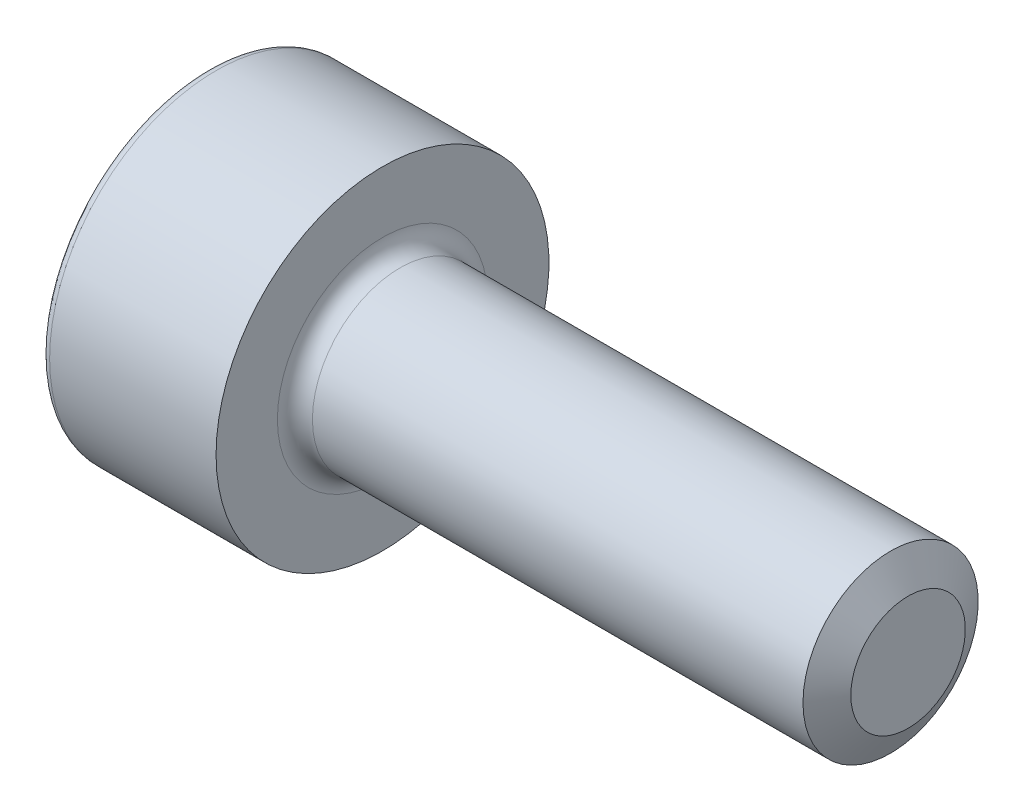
ISO-10303-21;
HEADER;
FILE_DESCRIPTION(('STEP AP214'),'2;1');
FILE_NAME('part.step','',(''),(''),'','','');
FILE_SCHEMA(('AUTOMOTIVE_DESIGN { 1 0 10303 214 1 1 1 1 }'));
ENDSEC;
DATA;
#1=APPLICATION_CONTEXT('core data for automotive mechanical design processes');
#2=APPLICATION_PROTOCOL_DEFINITION('international standard','automotive_design',2000,#1);
#3=PRODUCT_CONTEXT('',#1,'mechanical');
#4=PRODUCT('Part','Part','',(#3));
#5=PRODUCT_RELATED_PRODUCT_CATEGORY('part','',(#4));
#6=PRODUCT_DEFINITION_FORMATION('','',#4);
#7=PRODUCT_DEFINITION_CONTEXT('part definition',#1,'design');
#8=PRODUCT_DEFINITION('design','',#6,#7);
#9=PRODUCT_DEFINITION_SHAPE('','',#8);
#10=(LENGTH_UNIT() NAMED_UNIT(*) SI_UNIT(.MILLI.,.METRE.));
#11=(NAMED_UNIT(*) PLANE_ANGLE_UNIT() SI_UNIT($,.RADIAN.));
#12=(NAMED_UNIT(*) SI_UNIT($,.STERADIAN.) SOLID_ANGLE_UNIT());
#13=UNCERTAINTY_MEASURE_WITH_UNIT(LENGTH_MEASURE(1.E-05),#10,'distance_accuracy_value','');
#14=(GEOMETRIC_REPRESENTATION_CONTEXT(3) GLOBAL_UNCERTAINTY_ASSIGNED_CONTEXT((#13)) GLOBAL_UNIT_ASSIGNED_CONTEXT((#10,
#11,#12)) REPRESENTATION_CONTEXT('',''));
#15=CARTESIAN_POINT('',(0.,0.,0.));
#16=DIRECTION('',(0.,0.,1.));
#17=DIRECTION('',(1.,0.,0.));
#18=AXIS2_PLACEMENT_3D('',#15,#16,#17);
#19=CARTESIAN_POINT('',(8.,1.,0.));
#20=DIRECTION('',(-1.,0.,0.));
#21=DIRECTION('',(0.,0.,1.));
#22=AXIS2_PLACEMENT_3D('',#19,#20,#21);
#23=PLANE('',#22);
#24=CARTESIAN_POINT('',(8.,0.,0.));
#25=DIRECTION('',(-1.,0.,0.));
#26=DIRECTION('',(0.,0.,1.));
#27=AXIS2_PLACEMENT_3D('',#24,#25,#26);
#28=CIRCLE('',#27,0.6536);
#29=CARTESIAN_POINT('',(8.,0.,0.6536));
#30=VERTEX_POINT('',#29);
#31=EDGE_CURVE('E234',#30,#30,#28,.T.);
#32=ORIENTED_EDGE('',*,*,#31,.F.);
#33=EDGE_LOOP('',(#32));
#34=FACE_BOUND('',#33,.T.);
#35=ADVANCED_FACE('F17',(#34),#23,.F.);
#36=CARTESIAN_POINT('',(1.,0.749111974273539,0.4325));
#37=DIRECTION('',(-0.996035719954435,-0.0444770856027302,-0.0770365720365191));
#38=DIRECTION('',(-0.0771128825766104,0.,0.997022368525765));
#39=AXIS2_PLACEMENT_3D('',#36,#37,#38);
#40=PLANE('',#39);
#41=DIRECTION('',(-0.0771128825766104,0.863446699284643,0.498511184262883));
#42=VECTOR('',#41,1.);
#43=CARTESIAN_POINT('',(1.06690185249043,0.,0.));
#44=LINE('',#43,#42);
#45=CARTESIAN_POINT('',(1.06690185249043,0.,0.));
#46=VERTEX_POINT('',#45);
#47=CARTESIAN_POINT('',(1.,0.749111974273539,0.4325));
#48=VERTEX_POINT('',#47);
#49=EDGE_CURVE('E25',#46,#48,#44,.T.);
#50=ORIENTED_EDGE('',*,*,#49,.F.);
#51=DIRECTION('',(-0.0771128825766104,0.,0.997022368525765));
#52=VECTOR('',#51,1.);
#53=CARTESIAN_POINT('',(1.06690185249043,0.,0.));
#54=LINE('',#53,#52);
#55=CARTESIAN_POINT('',(1.,0.,0.865));
#56=VERTEX_POINT('',#55);
#57=EDGE_CURVE('E11',#46,#56,#54,.T.);
#58=ORIENTED_EDGE('',*,*,#57,.T.);
#59=DIRECTION('',(0.,0.866025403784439,-0.5));
#60=VECTOR('',#59,1.);
#61=CARTESIAN_POINT('',(1.,0.,0.865));
#62=LINE('',#61,#60);
#63=EDGE_CURVE('E100',#56,#48,#62,.T.);
#64=ORIENTED_EDGE('',*,*,#63,.T.);
#65=EDGE_LOOP('',(#50,#58,#64));
#66=FACE_BOUND('',#65,.T.);
#67=ADVANCED_FACE('F264',(#66),#40,.T.);
#68=CARTESIAN_POINT('',(1.,0.,0.865));
#69=DIRECTION('',(-0.996035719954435,0.0444770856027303,-0.0770365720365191));
#70=DIRECTION('',(-0.0771128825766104,0.,0.997022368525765));
#71=AXIS2_PLACEMENT_3D('',#68,#69,#70);
#72=PLANE('',#71);
#73=ORIENTED_EDGE('',*,*,#57,.F.);
#74=DIRECTION('',(-0.0771128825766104,-0.863446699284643,0.498511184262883));
#75=VECTOR('',#74,1.);
#76=CARTESIAN_POINT('',(1.06690185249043,0.,0.));
#77=LINE('',#76,#75);
#78=CARTESIAN_POINT('',(1.,-0.749111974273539,0.4325));
#79=VERTEX_POINT('',#78);
#80=EDGE_CURVE('E151',#46,#79,#77,.T.);
#81=ORIENTED_EDGE('',*,*,#80,.T.);
#82=DIRECTION('',(0.,0.866025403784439,0.5));
#83=VECTOR('',#82,1.);
#84=CARTESIAN_POINT('',(1.,-0.749111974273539,0.4325));
#85=LINE('',#84,#83);
#86=EDGE_CURVE('E104',#79,#56,#85,.T.);
#87=ORIENTED_EDGE('',*,*,#86,.T.);
#88=EDGE_LOOP('',(#73,#81,#87));
#89=FACE_BOUND('',#88,.T.);
#90=ADVANCED_FACE('F189',(#89),#72,.T.);
#91=CARTESIAN_POINT('',(1.,0.749111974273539,-0.4325));
#92=DIRECTION('',(-0.996035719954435,-0.0889541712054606,0.));
#93=DIRECTION('',(-0.0889541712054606,0.996035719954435,0.));
#94=AXIS2_PLACEMENT_3D('',#91,#92,#93);
#95=PLANE('',#94);
#96=DIRECTION('',(-0.0771128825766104,0.863446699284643,-0.498511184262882));
#97=VECTOR('',#96,1.);
#98=CARTESIAN_POINT('',(1.06690185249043,0.,0.));
#99=LINE('',#98,#97);
#100=CARTESIAN_POINT('',(1.,0.749111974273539,-0.4325));
#101=VERTEX_POINT('',#100);
#102=EDGE_CURVE('E183',#46,#101,#99,.T.);
#103=ORIENTED_EDGE('',*,*,#102,.F.);
#104=ORIENTED_EDGE('',*,*,#49,.T.);
#105=DIRECTION('',(0.,0.,-1.));
#106=VECTOR('',#105,1.);
#107=CARTESIAN_POINT('',(1.,0.749111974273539,0.4325));
#108=LINE('',#107,#106);
#109=EDGE_CURVE('E171',#48,#101,#108,.T.);
#110=ORIENTED_EDGE('',*,*,#109,.T.);
#111=EDGE_LOOP('',(#103,#104,#110));
#112=FACE_BOUND('',#111,.T.);
#113=ADVANCED_FACE('F210',(#112),#95,.T.);
#114=CARTESIAN_POINT('',(1.,-0.749111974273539,0.4325));
#115=DIRECTION('',(-0.996035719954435,0.0889541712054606,0.));
#116=DIRECTION('',(0.,0.,1.));
#117=AXIS2_PLACEMENT_3D('',#114,#115,#116);
#118=PLANE('',#117);
#119=ORIENTED_EDGE('',*,*,#80,.F.);
#120=DIRECTION('',(-0.0771128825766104,-0.863446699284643,-0.498511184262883));
#121=VECTOR('',#120,1.);
#122=CARTESIAN_POINT('',(1.06690185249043,0.,0.));
#123=LINE('',#122,#121);
#124=CARTESIAN_POINT('',(1.,-0.749111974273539,-0.4325));
#125=VERTEX_POINT('',#124);
#126=EDGE_CURVE('E179',#46,#125,#123,.T.);
#127=ORIENTED_EDGE('',*,*,#126,.T.);
#128=DIRECTION('',(0.,0.,1.));
#129=VECTOR('',#128,1.);
#130=CARTESIAN_POINT('',(1.,-0.749111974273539,-0.4325));
#131=LINE('',#130,#129);
#132=EDGE_CURVE('E156',#125,#79,#131,.T.);
#133=ORIENTED_EDGE('',*,*,#132,.T.);
#134=EDGE_LOOP('',(#119,#127,#133));
#135=FACE_BOUND('',#134,.T.);
#136=ADVANCED_FACE('F192',(#135),#118,.T.);
#137=CARTESIAN_POINT('',(1.,0.,-0.865));
#138=DIRECTION('',(-0.996035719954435,-0.0444770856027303,0.0770365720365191));
#139=DIRECTION('',(-0.0446096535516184,0.999004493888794,0.));
#140=AXIS2_PLACEMENT_3D('',#137,#138,#139);
#141=PLANE('',#140);
#142=DIRECTION('',(-0.0771128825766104,0.,-0.997022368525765));
#143=VECTOR('',#142,1.);
#144=CARTESIAN_POINT('',(1.06690185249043,0.,0.));
#145=LINE('',#144,#143);
#146=CARTESIAN_POINT('',(1.,0.,-0.865));
#147=VERTEX_POINT('',#146);
#148=EDGE_CURVE('E182',#46,#147,#145,.T.);
#149=ORIENTED_EDGE('',*,*,#148,.F.);
#150=ORIENTED_EDGE('',*,*,#102,.T.);
#151=DIRECTION('',(0.,-0.866025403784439,-0.5));
#152=VECTOR('',#151,1.);
#153=CARTESIAN_POINT('',(1.,0.749111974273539,-0.4325));
#154=LINE('',#153,#152);
#155=EDGE_CURVE('E163',#101,#147,#154,.T.);
#156=ORIENTED_EDGE('',*,*,#155,.T.);
#157=EDGE_LOOP('',(#149,#150,#156));
#158=FACE_BOUND('',#157,.T.);
#159=ADVANCED_FACE('F213',(#158),#141,.T.);
#160=CARTESIAN_POINT('',(1.,-0.749111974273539,-0.4325));
#161=DIRECTION('',(-0.996035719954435,0.0444770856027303,0.0770365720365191));
#162=DIRECTION('',(0.0446096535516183,0.999004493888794,0.));
#163=AXIS2_PLACEMENT_3D('',#160,#161,#162);
#164=PLANE('',#163);
#165=ORIENTED_EDGE('',*,*,#126,.F.);
#166=ORIENTED_EDGE('',*,*,#148,.T.);
#167=DIRECTION('',(0.,-0.866025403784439,0.5));
#168=VECTOR('',#167,1.);
#169=CARTESIAN_POINT('',(1.,0.,-0.865));
#170=LINE('',#169,#168);
#171=EDGE_CURVE('E164',#147,#125,#170,.T.);
#172=ORIENTED_EDGE('',*,*,#171,.T.);
#173=EDGE_LOOP('',(#165,#166,#172));
#174=FACE_BOUND('',#173,.T.);
#175=ADVANCED_FACE('F217',(#174),#164,.T.);
#176=CARTESIAN_POINT('',(1.,0.,0.865));
#177=DIRECTION('',(0.,0.5,0.866025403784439));
#178=DIRECTION('',(1.,0.,0.));
#179=AXIS2_PLACEMENT_3D('',#176,#177,#178);
#180=PLANE('',#179);
#181=DIRECTION('',(0.,0.866025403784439,-0.5));
#182=VECTOR('',#181,1.);
#183=CARTESIAN_POINT('',(0.,0.,0.865));
#184=LINE('',#183,#182);
#185=CARTESIAN_POINT('',(0.,0.,0.865));
#186=VERTEX_POINT('',#185);
#187=CARTESIAN_POINT('',(0.,0.749111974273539,0.4325));
#188=VERTEX_POINT('',#187);
#189=EDGE_CURVE('E99',#186,#188,#184,.T.);
#190=ORIENTED_EDGE('',*,*,#189,.T.);
#191=DIRECTION('',(-1.,0.,0.));
#192=VECTOR('',#191,1.);
#193=CARTESIAN_POINT('',(1.,0.749111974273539,0.4325));
#194=LINE('',#193,#192);
#195=EDGE_CURVE('E174',#48,#188,#194,.T.);
#196=ORIENTED_EDGE('',*,*,#195,.F.);
#197=ORIENTED_EDGE('',*,*,#63,.F.);
#198=DIRECTION('',(-1.,0.,0.));
#199=VECTOR('',#198,1.);
#200=CARTESIAN_POINT('',(1.,0.,0.865));
#201=LINE('',#200,#199);
#202=EDGE_CURVE('E94',#56,#186,#201,.T.);
#203=ORIENTED_EDGE('',*,*,#202,.T.);
#204=EDGE_LOOP('',(#190,#196,#197,#203));
#205=FACE_BOUND('',#204,.T.);
#206=ADVANCED_FACE('F96',(#205),#180,.F.);
#207=CARTESIAN_POINT('',(1.,0.749111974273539,0.4325));
#208=DIRECTION('',(0.,1.,0.));
#209=DIRECTION('',(0.,0.,-1.));
#210=AXIS2_PLACEMENT_3D('',#207,#208,#209);
#211=PLANE('',#210);
#212=DIRECTION('',(0.,0.,-1.));
#213=VECTOR('',#212,1.);
#214=CARTESIAN_POINT('',(0.,0.749111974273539,0.4325));
#215=LINE('',#214,#213);
#216=CARTESIAN_POINT('',(0.,0.749111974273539,-0.4325));
#217=VERTEX_POINT('',#216);
#218=EDGE_CURVE('E105',#188,#217,#215,.T.);
#219=ORIENTED_EDGE('',*,*,#218,.T.);
#220=DIRECTION('',(-1.,0.,0.));
#221=VECTOR('',#220,1.);
#222=CARTESIAN_POINT('',(1.,0.749111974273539,-0.4325));
#223=LINE('',#222,#221);
#224=EDGE_CURVE('E168',#101,#217,#223,.T.);
#225=ORIENTED_EDGE('',*,*,#224,.F.);
#226=ORIENTED_EDGE('',*,*,#109,.F.);
#227=ORIENTED_EDGE('',*,*,#195,.T.);
#228=EDGE_LOOP('',(#219,#225,#226,#227));
#229=FACE_BOUND('',#228,.T.);
#230=ADVANCED_FACE('F209',(#229),#211,.F.);
#231=CARTESIAN_POINT('',(1.,0.749111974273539,-0.4325));
#232=DIRECTION('',(0.,0.5,-0.866025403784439));
#233=DIRECTION('',(-1.,0.,0.));
#234=AXIS2_PLACEMENT_3D('',#231,#232,#233);
#235=PLANE('',#234);
#236=DIRECTION('',(0.,-0.866025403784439,-0.5));
#237=VECTOR('',#236,1.);
#238=CARTESIAN_POINT('',(0.,0.749111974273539,-0.4325));
#239=LINE('',#238,#237);
#240=CARTESIAN_POINT('',(0.,0.,-0.865));
#241=VERTEX_POINT('',#240);
#242=EDGE_CURVE('E140',#217,#241,#239,.T.);
#243=ORIENTED_EDGE('',*,*,#242,.T.);
#244=DIRECTION('',(-1.,0.,0.));
#245=VECTOR('',#244,1.);
#246=CARTESIAN_POINT('',(1.,0.,-0.865));
#247=LINE('',#246,#245);
#248=EDGE_CURVE('E160',#147,#241,#247,.T.);
#249=ORIENTED_EDGE('',*,*,#248,.F.);
#250=ORIENTED_EDGE('',*,*,#155,.F.);
#251=ORIENTED_EDGE('',*,*,#224,.T.);
#252=EDGE_LOOP('',(#243,#249,#250,#251));
#253=FACE_BOUND('',#252,.T.);
#254=ADVANCED_FACE('F205',(#253),#235,.F.);
#255=CARTESIAN_POINT('',(1.,0.,-0.865));
#256=DIRECTION('',(0.,-0.5,-0.866025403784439));
#257=DIRECTION('',(0.,-0.866025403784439,0.5));
#258=AXIS2_PLACEMENT_3D('',#255,#256,#257);
#259=PLANE('',#258);
#260=DIRECTION('',(0.,-0.866025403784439,0.5));
#261=VECTOR('',#260,1.);
#262=CARTESIAN_POINT('',(0.,0.,-0.865));
#263=LINE('',#262,#261);
#264=CARTESIAN_POINT('',(0.,-0.749111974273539,-0.4325));
#265=VERTEX_POINT('',#264);
#266=EDGE_CURVE('E139',#241,#265,#263,.T.);
#267=ORIENTED_EDGE('',*,*,#266,.T.);
#268=DIRECTION('',(-1.,0.,0.));
#269=VECTOR('',#268,1.);
#270=CARTESIAN_POINT('',(1.,-0.749111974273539,-0.4325));
#271=LINE('',#270,#269);
#272=EDGE_CURVE('E134',#125,#265,#271,.T.);
#273=ORIENTED_EDGE('',*,*,#272,.F.);
#274=ORIENTED_EDGE('',*,*,#171,.F.);
#275=ORIENTED_EDGE('',*,*,#248,.T.);
#276=EDGE_LOOP('',(#267,#273,#274,#275));
#277=FACE_BOUND('',#276,.T.);
#278=ADVANCED_FACE('F200',(#277),#259,.F.);
#279=CARTESIAN_POINT('',(1.,-0.749111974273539,-0.4325));
#280=DIRECTION('',(0.,-1.,0.));
#281=DIRECTION('',(0.,0.,-1.));
#282=AXIS2_PLACEMENT_3D('',#279,#280,#281);
#283=PLANE('',#282);
#284=DIRECTION('',(0.,0.,1.));
#285=VECTOR('',#284,1.);
#286=CARTESIAN_POINT('',(0.,-0.749111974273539,-0.4325));
#287=LINE('',#286,#285);
#288=CARTESIAN_POINT('',(0.,-0.749111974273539,0.4325));
#289=VERTEX_POINT('',#288);
#290=EDGE_CURVE('E116',#265,#289,#287,.T.);
#291=ORIENTED_EDGE('',*,*,#290,.T.);
#292=DIRECTION('',(-1.,0.,0.));
#293=VECTOR('',#292,1.);
#294=CARTESIAN_POINT('',(1.,-0.749111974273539,0.4325));
#295=LINE('',#294,#293);
#296=EDGE_CURVE('E111',#79,#289,#295,.T.);
#297=ORIENTED_EDGE('',*,*,#296,.F.);
#298=ORIENTED_EDGE('',*,*,#132,.F.);
#299=ORIENTED_EDGE('',*,*,#272,.T.);
#300=EDGE_LOOP('',(#291,#297,#298,#299));
#301=FACE_BOUND('',#300,.T.);
#302=ADVANCED_FACE('F196',(#301),#283,.F.);
#303=CARTESIAN_POINT('',(1.,-0.749111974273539,0.4325));
#304=DIRECTION('',(0.,-0.5,0.866025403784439));
#305=DIRECTION('',(-1.,0.,0.));
#306=AXIS2_PLACEMENT_3D('',#303,#304,#305);
#307=PLANE('',#306);
#308=DIRECTION('',(0.,0.866025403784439,0.5));
#309=VECTOR('',#308,1.);
#310=CARTESIAN_POINT('',(0.,-0.749111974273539,0.4325));
#311=LINE('',#310,#309);
#312=EDGE_CURVE('E108',#289,#186,#311,.T.);
#313=ORIENTED_EDGE('',*,*,#312,.T.);
#314=ORIENTED_EDGE('',*,*,#202,.F.);
#315=ORIENTED_EDGE('',*,*,#86,.F.);
#316=ORIENTED_EDGE('',*,*,#296,.T.);
#317=EDGE_LOOP('',(#313,#314,#315,#316));
#318=FACE_BOUND('',#317,.T.);
#319=ADVANCED_FACE('F109',(#318),#307,.F.);
#320=CARTESIAN_POINT('',(2.,1.9,0.));
#321=DIRECTION('',(-1.,0.,0.));
#322=DIRECTION('',(0.,0.,1.));
#323=AXIS2_PLACEMENT_3D('',#320,#321,#322);
#324=PLANE('',#323);
#325=CARTESIAN_POINT('',(2.,0.,0.));
#326=DIRECTION('',(-1.,0.,0.));
#327=DIRECTION('',(0.,0.,1.));
#328=AXIS2_PLACEMENT_3D('',#325,#326,#327);
#329=CIRCLE('',#328,1.2);
#330=CARTESIAN_POINT('',(2.,0.,1.2));
#331=VERTEX_POINT('',#330);
#332=EDGE_CURVE('E226',#331,#331,#329,.T.);
#333=ORIENTED_EDGE('',*,*,#332,.T.);
#334=EDGE_LOOP('',(#333));
#335=FACE_BOUND('',#334,.T.);
#336=CARTESIAN_POINT('',(2.,0.,0.));
#337=DIRECTION('',(-1.,0.,0.));
#338=DIRECTION('',(0.,0.,1.));
#339=AXIS2_PLACEMENT_3D('',#336,#337,#338);
#340=CIRCLE('',#339,1.9);
#341=CARTESIAN_POINT('',(2.,0.,1.9));
#342=VERTEX_POINT('',#341);
#343=EDGE_CURVE('E124',#342,#342,#340,.T.);
#344=ORIENTED_EDGE('',*,*,#343,.F.);
#345=EDGE_LOOP('',(#344));
#346=FACE_BOUND('',#345,.T.);
#347=ADVANCED_FACE('F293',(#335,#346),#324,.F.);
#348=CARTESIAN_POINT('',(0.,0.,0.));
#349=DIRECTION('',(1.,0.,0.));
#350=DIRECTION('',(0.,1.,0.));
#351=AXIS2_PLACEMENT_3D('',#348,#349,#350);
#352=PLANE('',#351);
#353=ORIENTED_EDGE('',*,*,#189,.F.);
#354=ORIENTED_EDGE('',*,*,#312,.F.);
#355=ORIENTED_EDGE('',*,*,#290,.F.);
#356=ORIENTED_EDGE('',*,*,#266,.F.);
#357=ORIENTED_EDGE('',*,*,#242,.F.);
#358=ORIENTED_EDGE('',*,*,#218,.F.);
#359=EDGE_LOOP('',(#353,#354,#355,#356,#357,#358));
#360=FACE_BOUND('',#359,.T.);
#361=CARTESIAN_POINT('',(0.,0.,0.));
#362=DIRECTION('',(-1.,0.,0.));
#363=DIRECTION('',(0.,0.,-1.));
#364=AXIS2_PLACEMENT_3D('',#361,#362,#363);
#365=CIRCLE('',#364,1.8);
#366=CARTESIAN_POINT('',(0.,0.,-1.8));
#367=VERTEX_POINT('',#366);
#368=EDGE_CURVE('E241',#367,#367,#365,.T.);
#369=ORIENTED_EDGE('',*,*,#368,.T.);
#370=EDGE_LOOP('',(#369));
#371=FACE_BOUND('',#370,.T.);
#372=ADVANCED_FACE('F119',(#360,#371),#352,.F.);
#373=CARTESIAN_POINT('',(0.,0.,0.));
#374=DIRECTION('',(-1.,0.,0.));
#375=DIRECTION('',(0.,0.,1.));
#376=AXIS2_PLACEMENT_3D('',#373,#374,#375);
#377=CYLINDRICAL_SURFACE('',#376,1.);
#378=CARTESIAN_POINT('',(2.2,0.,0.));
#379=DIRECTION('',(-1.,0.,0.));
#380=DIRECTION('',(0.,0.,1.));
#381=AXIS2_PLACEMENT_3D('',#378,#379,#380);
#382=CIRCLE('',#381,1.);
#383=CARTESIAN_POINT('',(2.2,0.,1.));
#384=VERTEX_POINT('',#383);
#385=EDGE_CURVE('E131',#384,#384,#382,.T.);
#386=ORIENTED_EDGE('',*,*,#385,.F.);
#387=EDGE_LOOP('',(#386));
#388=FACE_BOUND('',#387,.T.);
#389=CARTESIAN_POINT('',(7.80000586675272,0.,0.));
#390=DIRECTION('',(-1.,0.,0.));
#391=DIRECTION('',(0.,0.,1.));
#392=AXIS2_PLACEMENT_3D('',#389,#390,#391);
#393=CIRCLE('',#392,1.);
#394=CARTESIAN_POINT('',(7.80000586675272,0.,1.));
#395=VERTEX_POINT('',#394);
#396=EDGE_CURVE('E230',#395,#395,#393,.T.);
#397=ORIENTED_EDGE('',*,*,#396,.T.);
#398=EDGE_LOOP('',(#397));
#399=FACE_BOUND('',#398,.T.);
#400=ADVANCED_FACE('F301',(#388,#399),#377,.T.);
#401=CARTESIAN_POINT('',(0.,0.,0.));
#402=DIRECTION('',(-1.,0.,0.));
#403=DIRECTION('',(0.,0.,1.));
#404=AXIS2_PLACEMENT_3D('',#401,#402,#403);
#405=CYLINDRICAL_SURFACE('',#404,1.9);
#406=CARTESIAN_POINT('',(0.1,0.,0.));
#407=DIRECTION('',(1.,0.,0.));
#408=DIRECTION('',(0.,0.,-1.));
#409=AXIS2_PLACEMENT_3D('',#406,#407,#408);
#410=CIRCLE('',#409,1.9);
#411=CARTESIAN_POINT('',(0.1,0.,-1.9));
#412=VERTEX_POINT('',#411);
#413=EDGE_CURVE('E238',#412,#412,#410,.T.);
#414=ORIENTED_EDGE('',*,*,#413,.T.);
#415=EDGE_LOOP('',(#414));
#416=FACE_BOUND('',#415,.T.);
#417=ORIENTED_EDGE('',*,*,#343,.T.);
#418=EDGE_LOOP('',(#417));
#419=FACE_BOUND('',#418,.T.);
#420=ADVANCED_FACE('F304',(#416,#419),#405,.T.);
#421=CARTESIAN_POINT('',(2.2,0.,0.));
#422=DIRECTION('',(-1.,0.,0.));
#423=DIRECTION('',(0.,0.,1.));
#424=AXIS2_PLACEMENT_3D('',#421,#422,#423);
#425=TOROIDAL_SURFACE('',#424,1.2,0.2);
#426=ORIENTED_EDGE('',*,*,#385,.T.);
#427=EDGE_LOOP('',(#426));
#428=FACE_BOUND('',#427,.T.);
#429=ORIENTED_EDGE('',*,*,#332,.F.);
#430=EDGE_LOOP('',(#429));
#431=FACE_BOUND('',#430,.T.);
#432=ADVANCED_FACE('F258',(#428,#431),#425,.F.);
#433=CARTESIAN_POINT('',(7.80000586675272,0.,0.));
#434=DIRECTION('',(-1.,0.,0.));
#435=DIRECTION('',(0.,0.,1.));
#436=AXIS2_PLACEMENT_3D('',#433,#434,#435);
#437=CONICAL_SURFACE('',#436,1.,1.0471975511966);
#438=ORIENTED_EDGE('',*,*,#396,.F.);
#439=EDGE_LOOP('',(#438));
#440=FACE_BOUND('',#439,.T.);
#441=ORIENTED_EDGE('',*,*,#31,.T.);
#442=EDGE_LOOP('',(#441));
#443=FACE_BOUND('',#442,.T.);
#444=ADVANCED_FACE('F251',(#440,#443),#437,.T.);
#445=CARTESIAN_POINT('',(0.1,0.,0.));
#446=DIRECTION('',(1.,0.,0.));
#447=DIRECTION('',(0.,0.,-1.));
#448=AXIS2_PLACEMENT_3D('',#445,#446,#447);
#449=TOROIDAL_SURFACE('',#448,1.8,0.1);
#450=ORIENTED_EDGE('',*,*,#413,.F.);
#451=EDGE_LOOP('',(#450));
#452=FACE_BOUND('',#451,.T.);
#453=ORIENTED_EDGE('',*,*,#368,.F.);
#454=EDGE_LOOP('',(#453));
#455=FACE_BOUND('',#454,.T.);
#456=ADVANCED_FACE('F249',(#452,#455),#449,.T.);
#457=CLOSED_SHELL('',(#35,#67,#90,#113,#136,#159,#175,#206,#230,#254,#278,#302,#319,#347,#372,
#400,#420,#432,#444,#456));
#458=MANIFOLD_SOLID_BREP('B1',#457);
#459=ADVANCED_BREP_SHAPE_REPRESENTATION('',(#18,#458),#14);
#460=SHAPE_DEFINITION_REPRESENTATION(#9,#459);
ENDSEC;
END-ISO-10303-21;
